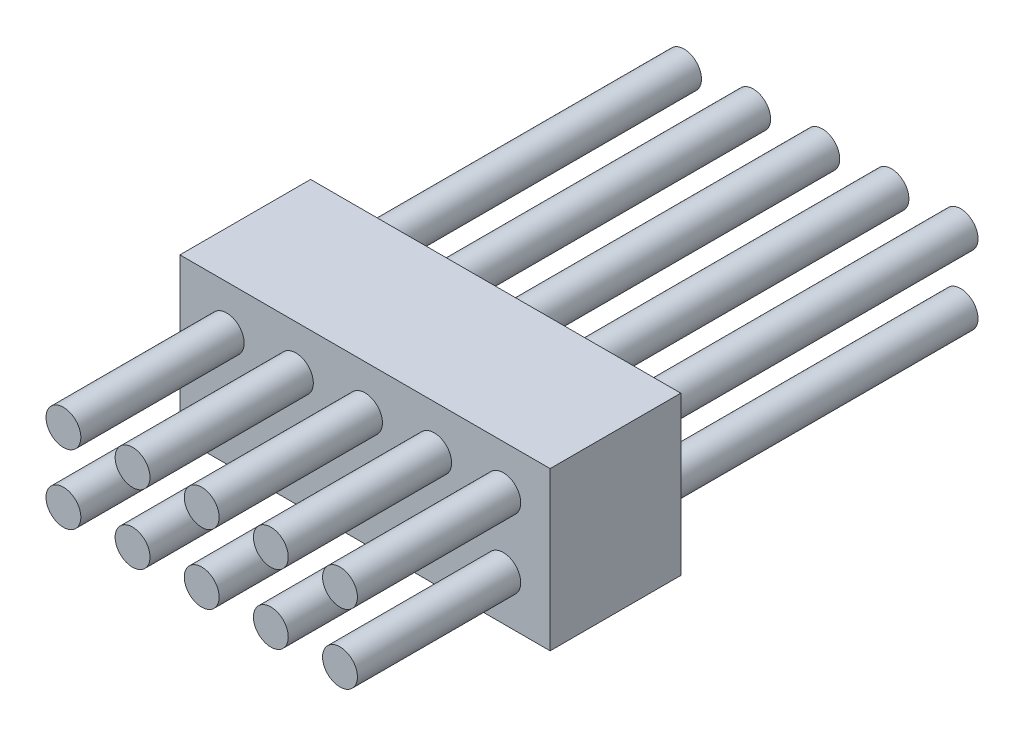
ISO-10303-21;
HEADER;
FILE_DESCRIPTION(('STEP AP214'),'2;1');
FILE_NAME('part.step','',(''),(''),'','','');
FILE_SCHEMA(('AUTOMOTIVE_DESIGN { 1 0 10303 214 1 1 1 1 }'));
ENDSEC;
DATA;
#1=APPLICATION_CONTEXT('core data for automotive mechanical design processes');
#2=APPLICATION_PROTOCOL_DEFINITION('international standard','automotive_design',2000,#1);
#3=PRODUCT_CONTEXT('',#1,'mechanical');
#4=PRODUCT('Part','Part','',(#3));
#5=PRODUCT_RELATED_PRODUCT_CATEGORY('part','',(#4));
#6=PRODUCT_DEFINITION_FORMATION('','',#4);
#7=PRODUCT_DEFINITION_CONTEXT('part definition',#1,'design');
#8=PRODUCT_DEFINITION('design','',#6,#7);
#9=PRODUCT_DEFINITION_SHAPE('','',#8);
#10=(LENGTH_UNIT() NAMED_UNIT(*) SI_UNIT(.MILLI.,.METRE.));
#11=(NAMED_UNIT(*) PLANE_ANGLE_UNIT() SI_UNIT($,.RADIAN.));
#12=(NAMED_UNIT(*) SI_UNIT($,.STERADIAN.) SOLID_ANGLE_UNIT());
#13=UNCERTAINTY_MEASURE_WITH_UNIT(LENGTH_MEASURE(1.E-05),#10,'distance_accuracy_value','');
#14=(GEOMETRIC_REPRESENTATION_CONTEXT(3) GLOBAL_UNCERTAINTY_ASSIGNED_CONTEXT((#13)) GLOBAL_UNIT_ASSIGNED_CONTEXT((#10,
#11,#12)) REPRESENTATION_CONTEXT('',''));
#15=CARTESIAN_POINT('',(0.,0.,0.));
#16=DIRECTION('',(0.,0.,1.));
#17=DIRECTION('',(1.,0.,0.));
#18=AXIS2_PLACEMENT_3D('',#15,#16,#17);
#19=CARTESIAN_POINT('',(0.,0.,2.4));
#20=DIRECTION('',(1.,0.,0.));
#21=DIRECTION('',(0.,0.,-1.));
#22=AXIS2_PLACEMENT_3D('',#19,#20,#21);
#23=PLANE('',#22);
#24=DIRECTION('',(0.,-1.,0.));
#25=VECTOR('',#24,1.);
#26=CARTESIAN_POINT('',(0.,0.,0.));
#27=LINE('',#26,#25);
#28=CARTESIAN_POINT('',(0.,2.9,0.));
#29=VERTEX_POINT('',#28);
#30=CARTESIAN_POINT('',(0.,0.,0.));
#31=VERTEX_POINT('',#30);
#32=EDGE_CURVE('E102',#29,#31,#27,.T.);
#33=ORIENTED_EDGE('',*,*,#32,.T.);
#34=DIRECTION('',(0.,0.,-1.));
#35=VECTOR('',#34,1.);
#36=CARTESIAN_POINT('',(0.,0.,2.4));
#37=LINE('',#36,#35);
#38=CARTESIAN_POINT('',(0.,0.,2.4));
#39=VERTEX_POINT('',#38);
#40=EDGE_CURVE('E93',#39,#31,#37,.T.);
#41=ORIENTED_EDGE('',*,*,#40,.F.);
#42=DIRECTION('',(0.,-1.,0.));
#43=VECTOR('',#42,1.);
#44=CARTESIAN_POINT('',(0.,0.,2.4));
#45=LINE('',#44,#43);
#46=CARTESIAN_POINT('',(0.,2.9,2.4));
#47=VERTEX_POINT('',#46);
#48=EDGE_CURVE('E87',#47,#39,#45,.T.);
#49=ORIENTED_EDGE('',*,*,#48,.F.);
#50=DIRECTION('',(0.,0.,-1.));
#51=VECTOR('',#50,1.);
#52=CARTESIAN_POINT('',(0.,2.9,2.4));
#53=LINE('',#52,#51);
#54=EDGE_CURVE('E98',#47,#29,#53,.T.);
#55=ORIENTED_EDGE('',*,*,#54,.T.);
#56=EDGE_LOOP('',(#33,#41,#49,#55));
#57=FACE_BOUND('',#56,.T.);
#58=ADVANCED_FACE('F35',(#57),#23,.F.);
#59=CARTESIAN_POINT('',(0.,0.,2.4));
#60=DIRECTION('',(0.,1.,0.));
#61=DIRECTION('',(0.,0.,1.));
#62=AXIS2_PLACEMENT_3D('',#59,#60,#61);
#63=PLANE('',#62);
#64=DIRECTION('',(1.,0.,0.));
#65=VECTOR('',#64,1.);
#66=CARTESIAN_POINT('',(0.,0.,0.));
#67=LINE('',#66,#65);
#68=CARTESIAN_POINT('',(6.8,0.,0.));
#69=VERTEX_POINT('',#68);
#70=EDGE_CURVE('E92',#31,#69,#67,.T.);
#71=ORIENTED_EDGE('',*,*,#70,.T.);
#72=DIRECTION('',(0.,0.,-1.));
#73=VECTOR('',#72,1.);
#74=CARTESIAN_POINT('',(6.8,0.,2.4));
#75=LINE('',#74,#73);
#76=CARTESIAN_POINT('',(6.8,0.,2.4));
#77=VERTEX_POINT('',#76);
#78=EDGE_CURVE('E90',#77,#69,#75,.T.);
#79=ORIENTED_EDGE('',*,*,#78,.F.);
#80=DIRECTION('',(1.,0.,0.));
#81=VECTOR('',#80,1.);
#82=CARTESIAN_POINT('',(0.,0.,2.4));
#83=LINE('',#82,#81);
#84=EDGE_CURVE('E82',#39,#77,#83,.T.);
#85=ORIENTED_EDGE('',*,*,#84,.F.);
#86=ORIENTED_EDGE('',*,*,#40,.T.);
#87=EDGE_LOOP('',(#71,#79,#85,#86));
#88=FACE_BOUND('',#87,.T.);
#89=ADVANCED_FACE('F91',(#88),#63,.F.);
#90=CARTESIAN_POINT('',(6.8,0.,2.4));
#91=DIRECTION('',(-1.,0.,0.));
#92=DIRECTION('',(0.,0.,1.));
#93=AXIS2_PLACEMENT_3D('',#90,#91,#92);
#94=PLANE('',#93);
#95=DIRECTION('',(0.,1.,0.));
#96=VECTOR('',#95,1.);
#97=CARTESIAN_POINT('',(6.8,0.,0.));
#98=LINE('',#97,#96);
#99=CARTESIAN_POINT('',(6.8,2.9,0.));
#100=VERTEX_POINT('',#99);
#101=EDGE_CURVE('E68',#69,#100,#98,.T.);
#102=ORIENTED_EDGE('',*,*,#101,.T.);
#103=DIRECTION('',(0.,0.,-1.));
#104=VECTOR('',#103,1.);
#105=CARTESIAN_POINT('',(6.8,2.9,2.4));
#106=LINE('',#105,#104);
#107=CARTESIAN_POINT('',(6.8,2.9,2.4));
#108=VERTEX_POINT('',#107);
#109=EDGE_CURVE('E94',#108,#100,#106,.T.);
#110=ORIENTED_EDGE('',*,*,#109,.F.);
#111=DIRECTION('',(0.,1.,0.));
#112=VECTOR('',#111,1.);
#113=CARTESIAN_POINT('',(6.8,0.,2.4));
#114=LINE('',#113,#112);
#115=EDGE_CURVE('E85',#77,#108,#114,.T.);
#116=ORIENTED_EDGE('',*,*,#115,.F.);
#117=ORIENTED_EDGE('',*,*,#78,.T.);
#118=EDGE_LOOP('',(#102,#110,#116,#117));
#119=FACE_BOUND('',#118,.T.);
#120=ADVANCED_FACE('F96',(#119),#94,.F.);
#121=CARTESIAN_POINT('',(0.,2.9,2.4));
#122=DIRECTION('',(0.,-1.,0.));
#123=DIRECTION('',(0.,0.,-1.));
#124=AXIS2_PLACEMENT_3D('',#121,#122,#123);
#125=PLANE('',#124);
#126=DIRECTION('',(-1.,0.,0.));
#127=VECTOR('',#126,1.);
#128=CARTESIAN_POINT('',(0.,2.9,0.));
#129=LINE('',#128,#127);
#130=EDGE_CURVE('E74',#100,#29,#129,.T.);
#131=ORIENTED_EDGE('',*,*,#130,.T.);
#132=ORIENTED_EDGE('',*,*,#54,.F.);
#133=DIRECTION('',(-1.,0.,0.));
#134=VECTOR('',#133,1.);
#135=CARTESIAN_POINT('',(0.,2.9,2.4));
#136=LINE('',#135,#134);
#137=EDGE_CURVE('E51',#108,#47,#136,.T.);
#138=ORIENTED_EDGE('',*,*,#137,.F.);
#139=ORIENTED_EDGE('',*,*,#109,.T.);
#140=EDGE_LOOP('',(#131,#132,#138,#139));
#141=FACE_BOUND('',#140,.T.);
#142=ADVANCED_FACE('F143',(#141),#125,.F.);
#143=CARTESIAN_POINT('',(0.,0.,2.4));
#144=DIRECTION('',(0.,0.,-1.));
#145=DIRECTION('',(-1.,0.,0.));
#146=AXIS2_PLACEMENT_3D('',#143,#144,#145);
#147=PLANE('',#146);
#148=CARTESIAN_POINT('',(5.94,2.085,2.4));
#149=DIRECTION('',(0.,0.,-1.));
#150=DIRECTION('',(-1.,0.,0.));
#151=AXIS2_PLACEMENT_3D('',#148,#149,#150);
#152=CIRCLE('',#151,0.32);
#153=CARTESIAN_POINT('',(5.62,2.085,2.4));
#154=VERTEX_POINT('',#153);
#155=EDGE_CURVE('E11',#154,#154,#152,.F.);
#156=ORIENTED_EDGE('',*,*,#155,.F.);
#157=EDGE_LOOP('',(#156));
#158=FACE_BOUND('',#157,.T.);
#159=CARTESIAN_POINT('',(5.94,0.815,2.4));
#160=DIRECTION('',(0.,0.,-1.));
#161=DIRECTION('',(-1.,0.,0.));
#162=AXIS2_PLACEMENT_3D('',#159,#160,#161);
#163=CIRCLE('',#162,0.32);
#164=CARTESIAN_POINT('',(5.62,0.815,2.4));
#165=VERTEX_POINT('',#164);
#166=EDGE_CURVE('E43',#165,#165,#163,.F.);
#167=ORIENTED_EDGE('',*,*,#166,.F.);
#168=EDGE_LOOP('',(#167));
#169=FACE_BOUND('',#168,.T.);
#170=CARTESIAN_POINT('',(4.67,2.085,2.4));
#171=DIRECTION('',(0.,0.,-1.));
#172=DIRECTION('',(-1.,0.,0.));
#173=AXIS2_PLACEMENT_3D('',#170,#171,#172);
#174=CIRCLE('',#173,0.32);
#175=CARTESIAN_POINT('',(4.35,2.085,2.4));
#176=VERTEX_POINT('',#175);
#177=EDGE_CURVE('E133',#176,#176,#174,.F.);
#178=ORIENTED_EDGE('',*,*,#177,.F.);
#179=EDGE_LOOP('',(#178));
#180=FACE_BOUND('',#179,.T.);
#181=CARTESIAN_POINT('',(4.67,0.815,2.4));
#182=DIRECTION('',(0.,0.,-1.));
#183=DIRECTION('',(-1.,0.,0.));
#184=AXIS2_PLACEMENT_3D('',#181,#182,#183);
#185=CIRCLE('',#184,0.32);
#186=CARTESIAN_POINT('',(4.35,0.815,2.4));
#187=VERTEX_POINT('',#186);
#188=EDGE_CURVE('E130',#187,#187,#185,.F.);
#189=ORIENTED_EDGE('',*,*,#188,.F.);
#190=EDGE_LOOP('',(#189));
#191=FACE_BOUND('',#190,.T.);
#192=CARTESIAN_POINT('',(3.4,2.085,2.4));
#193=DIRECTION('',(0.,0.,-1.));
#194=DIRECTION('',(-1.,0.,0.));
#195=AXIS2_PLACEMENT_3D('',#192,#193,#194);
#196=CIRCLE('',#195,0.32);
#197=CARTESIAN_POINT('',(3.08,2.085,2.4));
#198=VERTEX_POINT('',#197);
#199=EDGE_CURVE('E127',#198,#198,#196,.F.);
#200=ORIENTED_EDGE('',*,*,#199,.F.);
#201=EDGE_LOOP('',(#200));
#202=FACE_BOUND('',#201,.T.);
#203=CARTESIAN_POINT('',(3.4,0.815,2.4));
#204=DIRECTION('',(0.,0.,-1.));
#205=DIRECTION('',(-1.,0.,0.));
#206=AXIS2_PLACEMENT_3D('',#203,#204,#205);
#207=CIRCLE('',#206,0.32);
#208=CARTESIAN_POINT('',(3.08,0.815,2.4));
#209=VERTEX_POINT('',#208);
#210=EDGE_CURVE('E124',#209,#209,#207,.F.);
#211=ORIENTED_EDGE('',*,*,#210,.F.);
#212=EDGE_LOOP('',(#211));
#213=FACE_BOUND('',#212,.T.);
#214=CARTESIAN_POINT('',(2.13,2.085,2.4));
#215=DIRECTION('',(0.,0.,-1.));
#216=DIRECTION('',(-1.,0.,0.));
#217=AXIS2_PLACEMENT_3D('',#214,#215,#216);
#218=CIRCLE('',#217,0.32);
#219=CARTESIAN_POINT('',(1.81,2.085,2.4));
#220=VERTEX_POINT('',#219);
#221=EDGE_CURVE('E121',#220,#220,#218,.F.);
#222=ORIENTED_EDGE('',*,*,#221,.F.);
#223=EDGE_LOOP('',(#222));
#224=FACE_BOUND('',#223,.T.);
#225=CARTESIAN_POINT('',(2.13,0.815,2.4));
#226=DIRECTION('',(0.,0.,-1.));
#227=DIRECTION('',(-1.,0.,0.));
#228=AXIS2_PLACEMENT_3D('',#225,#226,#227);
#229=CIRCLE('',#228,0.32);
#230=CARTESIAN_POINT('',(1.81,0.815,2.4));
#231=VERTEX_POINT('',#230);
#232=EDGE_CURVE('E118',#231,#231,#229,.F.);
#233=ORIENTED_EDGE('',*,*,#232,.F.);
#234=EDGE_LOOP('',(#233));
#235=FACE_BOUND('',#234,.T.);
#236=CARTESIAN_POINT('',(0.86,2.085,2.4));
#237=DIRECTION('',(0.,0.,-1.));
#238=DIRECTION('',(-1.,0.,0.));
#239=AXIS2_PLACEMENT_3D('',#236,#237,#238);
#240=CIRCLE('',#239,0.32);
#241=CARTESIAN_POINT('',(0.54,2.085,2.4));
#242=VERTEX_POINT('',#241);
#243=EDGE_CURVE('E115',#242,#242,#240,.F.);
#244=ORIENTED_EDGE('',*,*,#243,.F.);
#245=EDGE_LOOP('',(#244));
#246=FACE_BOUND('',#245,.T.);
#247=CARTESIAN_POINT('',(0.86,0.815,2.4));
#248=DIRECTION('',(0.,0.,-1.));
#249=DIRECTION('',(-1.,0.,0.));
#250=AXIS2_PLACEMENT_3D('',#247,#248,#249);
#251=CIRCLE('',#250,0.32);
#252=CARTESIAN_POINT('',(0.54,0.815,2.4));
#253=VERTEX_POINT('',#252);
#254=EDGE_CURVE('E112',#253,#253,#251,.F.);
#255=ORIENTED_EDGE('',*,*,#254,.F.);
#256=EDGE_LOOP('',(#255));
#257=FACE_BOUND('',#256,.T.);
#258=ORIENTED_EDGE('',*,*,#48,.T.);
#259=ORIENTED_EDGE('',*,*,#84,.T.);
#260=ORIENTED_EDGE('',*,*,#115,.T.);
#261=ORIENTED_EDGE('',*,*,#137,.T.);
#262=EDGE_LOOP('',(#258,#259,#260,#261));
#263=FACE_BOUND('',#262,.T.);
#264=ADVANCED_FACE('F83',(#158,#169,#180,#191,#202,#213,#224,#235,#246,#257,#263),#147,.F.);
#265=CARTESIAN_POINT('',(0.,0.,0.));
#266=DIRECTION('',(0.,0.,-1.));
#267=DIRECTION('',(-1.,0.,0.));
#268=AXIS2_PLACEMENT_3D('',#265,#266,#267);
#269=PLANE('',#268);
#270=CARTESIAN_POINT('',(5.94,2.085,0.));
#271=DIRECTION('',(0.,0.,-1.));
#272=DIRECTION('',(-1.,0.,0.));
#273=AXIS2_PLACEMENT_3D('',#270,#271,#272);
#274=CIRCLE('',#273,0.32);
#275=CARTESIAN_POINT('',(5.62,2.085,0.));
#276=VERTEX_POINT('',#275);
#277=EDGE_CURVE('E612',#276,#276,#274,.T.);
#278=ORIENTED_EDGE('',*,*,#277,.F.);
#279=EDGE_LOOP('',(#278));
#280=FACE_BOUND('',#279,.T.);
#281=CARTESIAN_POINT('',(5.94,0.815,0.));
#282=DIRECTION('',(0.,0.,-1.));
#283=DIRECTION('',(-1.,0.,0.));
#284=AXIS2_PLACEMENT_3D('',#281,#282,#283);
#285=CIRCLE('',#284,0.32);
#286=CARTESIAN_POINT('',(5.62,0.815,0.));
#287=VERTEX_POINT('',#286);
#288=EDGE_CURVE('E611',#287,#287,#285,.T.);
#289=ORIENTED_EDGE('',*,*,#288,.F.);
#290=EDGE_LOOP('',(#289));
#291=FACE_BOUND('',#290,.T.);
#292=CARTESIAN_POINT('',(4.67,2.085,0.));
#293=DIRECTION('',(0.,0.,-1.));
#294=DIRECTION('',(-1.,0.,0.));
#295=AXIS2_PLACEMENT_3D('',#292,#293,#294);
#296=CIRCLE('',#295,0.32);
#297=CARTESIAN_POINT('',(4.35,2.085,0.));
#298=VERTEX_POINT('',#297);
#299=EDGE_CURVE('E621',#298,#298,#296,.T.);
#300=ORIENTED_EDGE('',*,*,#299,.F.);
#301=EDGE_LOOP('',(#300));
#302=FACE_BOUND('',#301,.T.);
#303=CARTESIAN_POINT('',(4.67,0.815,0.));
#304=DIRECTION('',(0.,0.,-1.));
#305=DIRECTION('',(-1.,0.,0.));
#306=AXIS2_PLACEMENT_3D('',#303,#304,#305);
#307=CIRCLE('',#306,0.32);
#308=CARTESIAN_POINT('',(4.35,0.815,0.));
#309=VERTEX_POINT('',#308);
#310=EDGE_CURVE('E626',#309,#309,#307,.T.);
#311=ORIENTED_EDGE('',*,*,#310,.F.);
#312=EDGE_LOOP('',(#311));
#313=FACE_BOUND('',#312,.T.);
#314=CARTESIAN_POINT('',(3.4,2.085,0.));
#315=DIRECTION('',(0.,0.,-1.));
#316=DIRECTION('',(-1.,0.,0.));
#317=AXIS2_PLACEMENT_3D('',#314,#315,#316);
#318=CIRCLE('',#317,0.32);
#319=CARTESIAN_POINT('',(3.08,2.085,0.));
#320=VERTEX_POINT('',#319);
#321=EDGE_CURVE('E632',#320,#320,#318,.T.);
#322=ORIENTED_EDGE('',*,*,#321,.F.);
#323=EDGE_LOOP('',(#322));
#324=FACE_BOUND('',#323,.T.);
#325=CARTESIAN_POINT('',(3.4,0.815,0.));
#326=DIRECTION('',(0.,0.,-1.));
#327=DIRECTION('',(-1.,0.,0.));
#328=AXIS2_PLACEMENT_3D('',#325,#326,#327);
#329=CIRCLE('',#328,0.32);
#330=CARTESIAN_POINT('',(3.08,0.815,0.));
#331=VERTEX_POINT('',#330);
#332=EDGE_CURVE('E638',#331,#331,#329,.T.);
#333=ORIENTED_EDGE('',*,*,#332,.F.);
#334=EDGE_LOOP('',(#333));
#335=FACE_BOUND('',#334,.T.);
#336=CARTESIAN_POINT('',(2.13,2.085,0.));
#337=DIRECTION('',(0.,0.,-1.));
#338=DIRECTION('',(-1.,0.,0.));
#339=AXIS2_PLACEMENT_3D('',#336,#337,#338);
#340=CIRCLE('',#339,0.32);
#341=CARTESIAN_POINT('',(1.81,2.085,0.));
#342=VERTEX_POINT('',#341);
#343=EDGE_CURVE('E644',#342,#342,#340,.T.);
#344=ORIENTED_EDGE('',*,*,#343,.F.);
#345=EDGE_LOOP('',(#344));
#346=FACE_BOUND('',#345,.T.);
#347=CARTESIAN_POINT('',(2.13,0.815,0.));
#348=DIRECTION('',(0.,0.,-1.));
#349=DIRECTION('',(-1.,0.,0.));
#350=AXIS2_PLACEMENT_3D('',#347,#348,#349);
#351=CIRCLE('',#350,0.32);
#352=CARTESIAN_POINT('',(1.81,0.815,0.));
#353=VERTEX_POINT('',#352);
#354=EDGE_CURVE('E650',#353,#353,#351,.T.);
#355=ORIENTED_EDGE('',*,*,#354,.F.);
#356=EDGE_LOOP('',(#355));
#357=FACE_BOUND('',#356,.T.);
#358=CARTESIAN_POINT('',(0.86,2.085,0.));
#359=DIRECTION('',(0.,0.,-1.));
#360=DIRECTION('',(-1.,0.,0.));
#361=AXIS2_PLACEMENT_3D('',#358,#359,#360);
#362=CIRCLE('',#361,0.32);
#363=CARTESIAN_POINT('',(0.54,2.085,0.));
#364=VERTEX_POINT('',#363);
#365=EDGE_CURVE('E656',#364,#364,#362,.T.);
#366=ORIENTED_EDGE('',*,*,#365,.F.);
#367=EDGE_LOOP('',(#366));
#368=FACE_BOUND('',#367,.T.);
#369=CARTESIAN_POINT('',(0.86,0.815,0.));
#370=DIRECTION('',(0.,0.,-1.));
#371=DIRECTION('',(-1.,0.,0.));
#372=AXIS2_PLACEMENT_3D('',#369,#370,#371);
#373=CIRCLE('',#372,0.32);
#374=CARTESIAN_POINT('',(0.54,0.815,0.));
#375=VERTEX_POINT('',#374);
#376=EDGE_CURVE('E662',#375,#375,#373,.T.);
#377=ORIENTED_EDGE('',*,*,#376,.F.);
#378=EDGE_LOOP('',(#377));
#379=FACE_BOUND('',#378,.T.);
#380=ORIENTED_EDGE('',*,*,#32,.F.);
#381=ORIENTED_EDGE('',*,*,#130,.F.);
#382=ORIENTED_EDGE('',*,*,#101,.F.);
#383=ORIENTED_EDGE('',*,*,#70,.F.);
#384=EDGE_LOOP('',(#380,#381,#382,#383));
#385=FACE_BOUND('',#384,.T.);
#386=ADVANCED_FACE('F142',(#280,#291,#302,#313,#324,#335,#346,#357,#368,#379,#385),#269,.T.);
#387=CARTESIAN_POINT('',(0.86,0.815,5.4));
#388=DIRECTION('',(0.,0.,-1.));
#389=DIRECTION('',(-1.,0.,0.));
#390=AXIS2_PLACEMENT_3D('',#387,#388,#389);
#391=CYLINDRICAL_SURFACE('',#390,0.32);
#392=CARTESIAN_POINT('',(0.86,0.815,5.4));
#393=DIRECTION('',(0.,0.,1.));
#394=DIRECTION('',(1.,0.,0.));
#395=AXIS2_PLACEMENT_3D('',#392,#393,#394);
#396=CIRCLE('',#395,0.32);
#397=CARTESIAN_POINT('',(1.18,0.815,5.4));
#398=VERTEX_POINT('',#397);
#399=EDGE_CURVE('E105',#398,#398,#396,.T.);
#400=ORIENTED_EDGE('',*,*,#399,.F.);
#401=EDGE_LOOP('',(#400));
#402=FACE_BOUND('',#401,.T.);
#403=ORIENTED_EDGE('',*,*,#254,.T.);
#404=EDGE_LOOP('',(#403));
#405=FACE_BOUND('',#404,.T.);
#406=ADVANCED_FACE('F162',(#402,#405),#391,.T.);
#407=CARTESIAN_POINT('',(0.86,0.815,5.4));
#408=DIRECTION('',(0.,0.,1.));
#409=DIRECTION('',(1.,0.,0.));
#410=AXIS2_PLACEMENT_3D('',#407,#408,#409);
#411=PLANE('',#410);
#412=ORIENTED_EDGE('',*,*,#399,.T.);
#413=EDGE_LOOP('',(#412));
#414=FACE_BOUND('',#413,.T.);
#415=ADVANCED_FACE('F164',(#414),#411,.T.);
#416=CARTESIAN_POINT('',(0.86,2.085,5.4));
#417=DIRECTION('',(0.,0.,-1.));
#418=DIRECTION('',(-1.,0.,0.));
#419=AXIS2_PLACEMENT_3D('',#416,#417,#418);
#420=CYLINDRICAL_SURFACE('',#419,0.32);
#421=CARTESIAN_POINT('',(0.86,2.085,5.4));
#422=DIRECTION('',(0.,0.,1.));
#423=DIRECTION('',(-1.,0.,0.));
#424=AXIS2_PLACEMENT_3D('',#421,#422,#423);
#425=CIRCLE('',#424,0.32);
#426=CARTESIAN_POINT('',(0.54,2.085,5.4));
#427=VERTEX_POINT('',#426);
#428=EDGE_CURVE('E694',#427,#427,#425,.T.);
#429=ORIENTED_EDGE('',*,*,#428,.F.);
#430=EDGE_LOOP('',(#429));
#431=FACE_BOUND('',#430,.T.);
#432=ORIENTED_EDGE('',*,*,#243,.T.);
#433=EDGE_LOOP('',(#432));
#434=FACE_BOUND('',#433,.T.);
#435=ADVANCED_FACE('F171',(#431,#434),#420,.T.);
#436=CARTESIAN_POINT('',(0.86,2.085,5.4));
#437=DIRECTION('',(0.,0.,-1.));
#438=DIRECTION('',(-1.,0.,0.));
#439=AXIS2_PLACEMENT_3D('',#436,#437,#438);
#440=PLANE('',#439);
#441=ORIENTED_EDGE('',*,*,#428,.T.);
#442=EDGE_LOOP('',(#441));
#443=FACE_BOUND('',#442,.T.);
#444=ADVANCED_FACE('F237',(#443),#440,.F.);
#445=CARTESIAN_POINT('',(2.13,0.815,5.4));
#446=DIRECTION('',(0.,0.,-1.));
#447=DIRECTION('',(-1.,0.,0.));
#448=AXIS2_PLACEMENT_3D('',#445,#446,#447);
#449=CYLINDRICAL_SURFACE('',#448,0.32);
#450=CARTESIAN_POINT('',(2.13,0.815,5.4));
#451=DIRECTION('',(0.,0.,1.));
#452=DIRECTION('',(1.,0.,0.));
#453=AXIS2_PLACEMENT_3D('',#450,#451,#452);
#454=CIRCLE('',#453,0.32);
#455=CARTESIAN_POINT('',(2.45,0.815,5.4));
#456=VERTEX_POINT('',#455);
#457=EDGE_CURVE('E691',#456,#456,#454,.T.);
#458=ORIENTED_EDGE('',*,*,#457,.F.);
#459=EDGE_LOOP('',(#458));
#460=FACE_BOUND('',#459,.T.);
#461=ORIENTED_EDGE('',*,*,#232,.T.);
#462=EDGE_LOOP('',(#461));
#463=FACE_BOUND('',#462,.T.);
#464=ADVANCED_FACE('F246',(#460,#463),#449,.T.);
#465=CARTESIAN_POINT('',(2.13,0.815,5.4));
#466=DIRECTION('',(0.,0.,1.));
#467=DIRECTION('',(1.,0.,0.));
#468=AXIS2_PLACEMENT_3D('',#465,#466,#467);
#469=PLANE('',#468);
#470=ORIENTED_EDGE('',*,*,#457,.T.);
#471=EDGE_LOOP('',(#470));
#472=FACE_BOUND('',#471,.T.);
#473=ADVANCED_FACE('F255',(#472),#469,.T.);
#474=CARTESIAN_POINT('',(2.13,2.085,5.4));
#475=DIRECTION('',(0.,0.,-1.));
#476=DIRECTION('',(-1.,0.,0.));
#477=AXIS2_PLACEMENT_3D('',#474,#475,#476);
#478=CYLINDRICAL_SURFACE('',#477,0.32);
#479=CARTESIAN_POINT('',(2.13,2.085,5.4));
#480=DIRECTION('',(0.,0.,1.));
#481=DIRECTION('',(-1.,0.,0.));
#482=AXIS2_PLACEMENT_3D('',#479,#480,#481);
#483=CIRCLE('',#482,0.32);
#484=CARTESIAN_POINT('',(1.81,2.085,5.4));
#485=VERTEX_POINT('',#484);
#486=EDGE_CURVE('E688',#485,#485,#483,.T.);
#487=ORIENTED_EDGE('',*,*,#486,.F.);
#488=EDGE_LOOP('',(#487));
#489=FACE_BOUND('',#488,.T.);
#490=ORIENTED_EDGE('',*,*,#221,.T.);
#491=EDGE_LOOP('',(#490));
#492=FACE_BOUND('',#491,.T.);
#493=ADVANCED_FACE('F264',(#489,#492),#478,.T.);
#494=CARTESIAN_POINT('',(2.13,2.085,5.4));
#495=DIRECTION('',(0.,0.,-1.));
#496=DIRECTION('',(-1.,0.,0.));
#497=AXIS2_PLACEMENT_3D('',#494,#495,#496);
#498=PLANE('',#497);
#499=ORIENTED_EDGE('',*,*,#486,.T.);
#500=EDGE_LOOP('',(#499));
#501=FACE_BOUND('',#500,.T.);
#502=ADVANCED_FACE('F273',(#501),#498,.F.);
#503=CARTESIAN_POINT('',(3.4,0.815,5.4));
#504=DIRECTION('',(0.,0.,-1.));
#505=DIRECTION('',(-1.,0.,0.));
#506=AXIS2_PLACEMENT_3D('',#503,#504,#505);
#507=CYLINDRICAL_SURFACE('',#506,0.32);
#508=CARTESIAN_POINT('',(3.4,0.815,5.4));
#509=DIRECTION('',(0.,0.,1.));
#510=DIRECTION('',(1.,0.,0.));
#511=AXIS2_PLACEMENT_3D('',#508,#509,#510);
#512=CIRCLE('',#511,0.32);
#513=CARTESIAN_POINT('',(3.72,0.815,5.4));
#514=VERTEX_POINT('',#513);
#515=EDGE_CURVE('E685',#514,#514,#512,.T.);
#516=ORIENTED_EDGE('',*,*,#515,.F.);
#517=EDGE_LOOP('',(#516));
#518=FACE_BOUND('',#517,.T.);
#519=ORIENTED_EDGE('',*,*,#210,.T.);
#520=EDGE_LOOP('',(#519));
#521=FACE_BOUND('',#520,.T.);
#522=ADVANCED_FACE('F282',(#518,#521),#507,.T.);
#523=CARTESIAN_POINT('',(3.4,0.815,5.4));
#524=DIRECTION('',(0.,0.,1.));
#525=DIRECTION('',(1.,0.,0.));
#526=AXIS2_PLACEMENT_3D('',#523,#524,#525);
#527=PLANE('',#526);
#528=ORIENTED_EDGE('',*,*,#515,.T.);
#529=EDGE_LOOP('',(#528));
#530=FACE_BOUND('',#529,.T.);
#531=ADVANCED_FACE('F291',(#530),#527,.T.);
#532=CARTESIAN_POINT('',(3.4,2.085,5.4));
#533=DIRECTION('',(0.,0.,-1.));
#534=DIRECTION('',(-1.,0.,0.));
#535=AXIS2_PLACEMENT_3D('',#532,#533,#534);
#536=CYLINDRICAL_SURFACE('',#535,0.32);
#537=CARTESIAN_POINT('',(3.4,2.085,5.4));
#538=DIRECTION('',(0.,0.,1.));
#539=DIRECTION('',(-1.,0.,0.));
#540=AXIS2_PLACEMENT_3D('',#537,#538,#539);
#541=CIRCLE('',#540,0.32);
#542=CARTESIAN_POINT('',(3.08,2.085,5.4));
#543=VERTEX_POINT('',#542);
#544=EDGE_CURVE('E682',#543,#543,#541,.T.);
#545=ORIENTED_EDGE('',*,*,#544,.F.);
#546=EDGE_LOOP('',(#545));
#547=FACE_BOUND('',#546,.T.);
#548=ORIENTED_EDGE('',*,*,#199,.T.);
#549=EDGE_LOOP('',(#548));
#550=FACE_BOUND('',#549,.T.);
#551=ADVANCED_FACE('F300',(#547,#550),#536,.T.);
#552=CARTESIAN_POINT('',(3.4,2.085,5.4));
#553=DIRECTION('',(0.,0.,-1.));
#554=DIRECTION('',(-1.,0.,0.));
#555=AXIS2_PLACEMENT_3D('',#552,#553,#554);
#556=PLANE('',#555);
#557=ORIENTED_EDGE('',*,*,#544,.T.);
#558=EDGE_LOOP('',(#557));
#559=FACE_BOUND('',#558,.T.);
#560=ADVANCED_FACE('F309',(#559),#556,.F.);
#561=CARTESIAN_POINT('',(4.67,0.815,5.4));
#562=DIRECTION('',(0.,0.,-1.));
#563=DIRECTION('',(-1.,0.,0.));
#564=AXIS2_PLACEMENT_3D('',#561,#562,#563);
#565=CYLINDRICAL_SURFACE('',#564,0.32);
#566=CARTESIAN_POINT('',(4.67,0.815,5.4));
#567=DIRECTION('',(0.,0.,1.));
#568=DIRECTION('',(1.,0.,0.));
#569=AXIS2_PLACEMENT_3D('',#566,#567,#568);
#570=CIRCLE('',#569,0.32);
#571=CARTESIAN_POINT('',(4.99,0.815,5.4));
#572=VERTEX_POINT('',#571);
#573=EDGE_CURVE('E679',#572,#572,#570,.T.);
#574=ORIENTED_EDGE('',*,*,#573,.F.);
#575=EDGE_LOOP('',(#574));
#576=FACE_BOUND('',#575,.T.);
#577=ORIENTED_EDGE('',*,*,#188,.T.);
#578=EDGE_LOOP('',(#577));
#579=FACE_BOUND('',#578,.T.);
#580=ADVANCED_FACE('F318',(#576,#579),#565,.T.);
#581=CARTESIAN_POINT('',(4.67,0.815,5.4));
#582=DIRECTION('',(0.,0.,1.));
#583=DIRECTION('',(1.,0.,0.));
#584=AXIS2_PLACEMENT_3D('',#581,#582,#583);
#585=PLANE('',#584);
#586=ORIENTED_EDGE('',*,*,#573,.T.);
#587=EDGE_LOOP('',(#586));
#588=FACE_BOUND('',#587,.T.);
#589=ADVANCED_FACE('F327',(#588),#585,.T.);
#590=CARTESIAN_POINT('',(4.67,2.085,5.4));
#591=DIRECTION('',(0.,0.,-1.));
#592=DIRECTION('',(-1.,0.,0.));
#593=AXIS2_PLACEMENT_3D('',#590,#591,#592);
#594=CYLINDRICAL_SURFACE('',#593,0.32);
#595=CARTESIAN_POINT('',(4.67,2.085,5.4));
#596=DIRECTION('',(0.,0.,1.));
#597=DIRECTION('',(-1.,0.,0.));
#598=AXIS2_PLACEMENT_3D('',#595,#596,#597);
#599=CIRCLE('',#598,0.32);
#600=CARTESIAN_POINT('',(4.35,2.085,5.4));
#601=VERTEX_POINT('',#600);
#602=EDGE_CURVE('E676',#601,#601,#599,.T.);
#603=ORIENTED_EDGE('',*,*,#602,.F.);
#604=EDGE_LOOP('',(#603));
#605=FACE_BOUND('',#604,.T.);
#606=ORIENTED_EDGE('',*,*,#177,.T.);
#607=EDGE_LOOP('',(#606));
#608=FACE_BOUND('',#607,.T.);
#609=ADVANCED_FACE('F336',(#605,#608),#594,.T.);
#610=CARTESIAN_POINT('',(4.67,2.085,5.4));
#611=DIRECTION('',(0.,0.,-1.));
#612=DIRECTION('',(-1.,0.,0.));
#613=AXIS2_PLACEMENT_3D('',#610,#611,#612);
#614=PLANE('',#613);
#615=ORIENTED_EDGE('',*,*,#602,.T.);
#616=EDGE_LOOP('',(#615));
#617=FACE_BOUND('',#616,.T.);
#618=ADVANCED_FACE('F345',(#617),#614,.F.);
#619=CARTESIAN_POINT('',(5.94,0.815,5.4));
#620=DIRECTION('',(0.,0.,-1.));
#621=DIRECTION('',(-1.,0.,0.));
#622=AXIS2_PLACEMENT_3D('',#619,#620,#621);
#623=CYLINDRICAL_SURFACE('',#622,0.32);
#624=CARTESIAN_POINT('',(5.94,0.815,5.4));
#625=DIRECTION('',(0.,0.,1.));
#626=DIRECTION('',(1.,0.,0.));
#627=AXIS2_PLACEMENT_3D('',#624,#625,#626);
#628=CIRCLE('',#627,0.32);
#629=CARTESIAN_POINT('',(6.26,0.815,5.4));
#630=VERTEX_POINT('',#629);
#631=EDGE_CURVE('E673',#630,#630,#628,.T.);
#632=ORIENTED_EDGE('',*,*,#631,.F.);
#633=EDGE_LOOP('',(#632));
#634=FACE_BOUND('',#633,.T.);
#635=ORIENTED_EDGE('',*,*,#166,.T.);
#636=EDGE_LOOP('',(#635));
#637=FACE_BOUND('',#636,.T.);
#638=ADVANCED_FACE('F138',(#634,#637),#623,.T.);
#639=CARTESIAN_POINT('',(5.94,0.815,5.4));
#640=DIRECTION('',(0.,0.,1.));
#641=DIRECTION('',(1.,0.,0.));
#642=AXIS2_PLACEMENT_3D('',#639,#640,#641);
#643=PLANE('',#642);
#644=ORIENTED_EDGE('',*,*,#631,.T.);
#645=EDGE_LOOP('',(#644));
#646=FACE_BOUND('',#645,.T.);
#647=ADVANCED_FACE('F362',(#646),#643,.T.);
#648=CARTESIAN_POINT('',(5.94,2.085,5.4));
#649=DIRECTION('',(0.,0.,-1.));
#650=DIRECTION('',(-1.,0.,0.));
#651=AXIS2_PLACEMENT_3D('',#648,#649,#650);
#652=CYLINDRICAL_SURFACE('',#651,0.32);
#653=CARTESIAN_POINT('',(5.94,2.085,5.4));
#654=DIRECTION('',(0.,0.,1.));
#655=DIRECTION('',(-1.,0.,0.));
#656=AXIS2_PLACEMENT_3D('',#653,#654,#655);
#657=CIRCLE('',#656,0.32);
#658=CARTESIAN_POINT('',(5.62,2.085,5.4));
#659=VERTEX_POINT('',#658);
#660=EDGE_CURVE('E668',#659,#659,#657,.T.);
#661=ORIENTED_EDGE('',*,*,#660,.F.);
#662=EDGE_LOOP('',(#661));
#663=FACE_BOUND('',#662,.T.);
#664=ORIENTED_EDGE('',*,*,#155,.T.);
#665=EDGE_LOOP('',(#664));
#666=FACE_BOUND('',#665,.T.);
#667=ADVANCED_FACE('F371',(#663,#666),#652,.T.);
#668=CARTESIAN_POINT('',(5.94,2.085,5.4));
#669=DIRECTION('',(0.,0.,-1.));
#670=DIRECTION('',(-1.,0.,0.));
#671=AXIS2_PLACEMENT_3D('',#668,#669,#670);
#672=PLANE('',#671);
#673=ORIENTED_EDGE('',*,*,#660,.T.);
#674=EDGE_LOOP('',(#673));
#675=FACE_BOUND('',#674,.T.);
#676=ADVANCED_FACE('F380',(#675),#672,.F.);
#677=CARTESIAN_POINT('',(0.86,0.815,-6.));
#678=DIRECTION('',(0.,0.,1.));
#679=DIRECTION('',(1.,0.,0.));
#680=AXIS2_PLACEMENT_3D('',#677,#678,#679);
#681=CYLINDRICAL_SURFACE('',#680,0.32);
#682=CARTESIAN_POINT('',(0.86,0.815,-6.));
#683=DIRECTION('',(0.,0.,-1.));
#684=DIRECTION('',(-1.,0.,0.));
#685=AXIS2_PLACEMENT_3D('',#682,#683,#684);
#686=CIRCLE('',#685,0.32);
#687=CARTESIAN_POINT('',(0.54,0.815,-6.));
#688=VERTEX_POINT('',#687);
#689=EDGE_CURVE('E665',#688,#688,#686,.T.);
#690=ORIENTED_EDGE('',*,*,#689,.F.);
#691=EDGE_LOOP('',(#690));
#692=FACE_BOUND('',#691,.T.);
#693=ORIENTED_EDGE('',*,*,#376,.T.);
#694=EDGE_LOOP('',(#693));
#695=FACE_BOUND('',#694,.T.);
#696=ADVANCED_FACE('F388',(#692,#695),#681,.T.);
#697=CARTESIAN_POINT('',(0.86,0.815,-6.));
#698=DIRECTION('',(0.,0.,-1.));
#699=DIRECTION('',(-1.,0.,0.));
#700=AXIS2_PLACEMENT_3D('',#697,#698,#699);
#701=PLANE('',#700);
#702=ORIENTED_EDGE('',*,*,#689,.T.);
#703=EDGE_LOOP('',(#702));
#704=FACE_BOUND('',#703,.T.);
#705=ADVANCED_FACE('F396',(#704),#701,.T.);
#706=CARTESIAN_POINT('',(0.86,2.085,-6.));
#707=DIRECTION('',(0.,0.,1.));
#708=DIRECTION('',(1.,0.,0.));
#709=AXIS2_PLACEMENT_3D('',#706,#707,#708);
#710=CYLINDRICAL_SURFACE('',#709,0.32);
#711=CARTESIAN_POINT('',(0.86,2.085,-6.));
#712=DIRECTION('',(0.,0.,-1.));
#713=DIRECTION('',(-1.,0.,0.));
#714=AXIS2_PLACEMENT_3D('',#711,#712,#713);
#715=CIRCLE('',#714,0.32);
#716=CARTESIAN_POINT('',(0.54,2.085,-6.));
#717=VERTEX_POINT('',#716);
#718=EDGE_CURVE('E659',#717,#717,#715,.T.);
#719=ORIENTED_EDGE('',*,*,#718,.F.);
#720=EDGE_LOOP('',(#719));
#721=FACE_BOUND('',#720,.T.);
#722=ORIENTED_EDGE('',*,*,#365,.T.);
#723=EDGE_LOOP('',(#722));
#724=FACE_BOUND('',#723,.T.);
#725=ADVANCED_FACE('F405',(#721,#724),#710,.T.);
#726=CARTESIAN_POINT('',(0.86,2.085,-6.));
#727=DIRECTION('',(0.,0.,-1.));
#728=DIRECTION('',(-1.,0.,0.));
#729=AXIS2_PLACEMENT_3D('',#726,#727,#728);
#730=PLANE('',#729);
#731=ORIENTED_EDGE('',*,*,#718,.T.);
#732=EDGE_LOOP('',(#731));
#733=FACE_BOUND('',#732,.T.);
#734=ADVANCED_FACE('F414',(#733),#730,.T.);
#735=CARTESIAN_POINT('',(2.13,0.815,-6.));
#736=DIRECTION('',(0.,0.,1.));
#737=DIRECTION('',(1.,0.,0.));
#738=AXIS2_PLACEMENT_3D('',#735,#736,#737);
#739=CYLINDRICAL_SURFACE('',#738,0.32);
#740=CARTESIAN_POINT('',(2.13,0.815,-6.));
#741=DIRECTION('',(0.,0.,-1.));
#742=DIRECTION('',(-1.,0.,0.));
#743=AXIS2_PLACEMENT_3D('',#740,#741,#742);
#744=CIRCLE('',#743,0.32);
#745=CARTESIAN_POINT('',(1.81,0.815,-6.));
#746=VERTEX_POINT('',#745);
#747=EDGE_CURVE('E653',#746,#746,#744,.T.);
#748=ORIENTED_EDGE('',*,*,#747,.F.);
#749=EDGE_LOOP('',(#748));
#750=FACE_BOUND('',#749,.T.);
#751=ORIENTED_EDGE('',*,*,#354,.T.);
#752=EDGE_LOOP('',(#751));
#753=FACE_BOUND('',#752,.T.);
#754=ADVANCED_FACE('F423',(#750,#753),#739,.T.);
#755=CARTESIAN_POINT('',(2.13,0.815,-6.));
#756=DIRECTION('',(0.,0.,-1.));
#757=DIRECTION('',(-1.,0.,0.));
#758=AXIS2_PLACEMENT_3D('',#755,#756,#757);
#759=PLANE('',#758);
#760=ORIENTED_EDGE('',*,*,#747,.T.);
#761=EDGE_LOOP('',(#760));
#762=FACE_BOUND('',#761,.T.);
#763=ADVANCED_FACE('F432',(#762),#759,.T.);
#764=CARTESIAN_POINT('',(2.13,2.085,-6.));
#765=DIRECTION('',(0.,0.,1.));
#766=DIRECTION('',(1.,0.,0.));
#767=AXIS2_PLACEMENT_3D('',#764,#765,#766);
#768=CYLINDRICAL_SURFACE('',#767,0.32);
#769=CARTESIAN_POINT('',(2.13,2.085,-6.));
#770=DIRECTION('',(0.,0.,-1.));
#771=DIRECTION('',(-1.,0.,0.));
#772=AXIS2_PLACEMENT_3D('',#769,#770,#771);
#773=CIRCLE('',#772,0.32);
#774=CARTESIAN_POINT('',(1.81,2.085,-6.));
#775=VERTEX_POINT('',#774);
#776=EDGE_CURVE('E647',#775,#775,#773,.T.);
#777=ORIENTED_EDGE('',*,*,#776,.F.);
#778=EDGE_LOOP('',(#777));
#779=FACE_BOUND('',#778,.T.);
#780=ORIENTED_EDGE('',*,*,#343,.T.);
#781=EDGE_LOOP('',(#780));
#782=FACE_BOUND('',#781,.T.);
#783=ADVANCED_FACE('F441',(#779,#782),#768,.T.);
#784=CARTESIAN_POINT('',(2.13,2.085,-6.));
#785=DIRECTION('',(0.,0.,-1.));
#786=DIRECTION('',(-1.,0.,0.));
#787=AXIS2_PLACEMENT_3D('',#784,#785,#786);
#788=PLANE('',#787);
#789=ORIENTED_EDGE('',*,*,#776,.T.);
#790=EDGE_LOOP('',(#789));
#791=FACE_BOUND('',#790,.T.);
#792=ADVANCED_FACE('F450',(#791),#788,.T.);
#793=CARTESIAN_POINT('',(3.4,0.815,-6.));
#794=DIRECTION('',(0.,0.,1.));
#795=DIRECTION('',(1.,0.,0.));
#796=AXIS2_PLACEMENT_3D('',#793,#794,#795);
#797=CYLINDRICAL_SURFACE('',#796,0.32);
#798=CARTESIAN_POINT('',(3.4,0.815,-6.));
#799=DIRECTION('',(0.,0.,-1.));
#800=DIRECTION('',(-1.,0.,0.));
#801=AXIS2_PLACEMENT_3D('',#798,#799,#800);
#802=CIRCLE('',#801,0.32);
#803=CARTESIAN_POINT('',(3.08,0.815,-6.));
#804=VERTEX_POINT('',#803);
#805=EDGE_CURVE('E641',#804,#804,#802,.T.);
#806=ORIENTED_EDGE('',*,*,#805,.F.);
#807=EDGE_LOOP('',(#806));
#808=FACE_BOUND('',#807,.T.);
#809=ORIENTED_EDGE('',*,*,#332,.T.);
#810=EDGE_LOOP('',(#809));
#811=FACE_BOUND('',#810,.T.);
#812=ADVANCED_FACE('F459',(#808,#811),#797,.T.);
#813=CARTESIAN_POINT('',(3.4,0.815,-6.));
#814=DIRECTION('',(0.,0.,-1.));
#815=DIRECTION('',(-1.,0.,0.));
#816=AXIS2_PLACEMENT_3D('',#813,#814,#815);
#817=PLANE('',#816);
#818=ORIENTED_EDGE('',*,*,#805,.T.);
#819=EDGE_LOOP('',(#818));
#820=FACE_BOUND('',#819,.T.);
#821=ADVANCED_FACE('F468',(#820),#817,.T.);
#822=CARTESIAN_POINT('',(3.4,2.085,-6.));
#823=DIRECTION('',(0.,0.,1.));
#824=DIRECTION('',(1.,0.,0.));
#825=AXIS2_PLACEMENT_3D('',#822,#823,#824);
#826=CYLINDRICAL_SURFACE('',#825,0.32);
#827=CARTESIAN_POINT('',(3.4,2.085,-6.));
#828=DIRECTION('',(0.,0.,-1.));
#829=DIRECTION('',(-1.,0.,0.));
#830=AXIS2_PLACEMENT_3D('',#827,#828,#829);
#831=CIRCLE('',#830,0.32);
#832=CARTESIAN_POINT('',(3.08,2.085,-6.));
#833=VERTEX_POINT('',#832);
#834=EDGE_CURVE('E635',#833,#833,#831,.T.);
#835=ORIENTED_EDGE('',*,*,#834,.F.);
#836=EDGE_LOOP('',(#835));
#837=FACE_BOUND('',#836,.T.);
#838=ORIENTED_EDGE('',*,*,#321,.T.);
#839=EDGE_LOOP('',(#838));
#840=FACE_BOUND('',#839,.T.);
#841=ADVANCED_FACE('F477',(#837,#840),#826,.T.);
#842=CARTESIAN_POINT('',(3.4,2.085,-6.));
#843=DIRECTION('',(0.,0.,-1.));
#844=DIRECTION('',(-1.,0.,0.));
#845=AXIS2_PLACEMENT_3D('',#842,#843,#844);
#846=PLANE('',#845);
#847=ORIENTED_EDGE('',*,*,#834,.T.);
#848=EDGE_LOOP('',(#847));
#849=FACE_BOUND('',#848,.T.);
#850=ADVANCED_FACE('F486',(#849),#846,.T.);
#851=CARTESIAN_POINT('',(4.67,0.815,-6.));
#852=DIRECTION('',(0.,0.,1.));
#853=DIRECTION('',(1.,0.,0.));
#854=AXIS2_PLACEMENT_3D('',#851,#852,#853);
#855=CYLINDRICAL_SURFACE('',#854,0.32);
#856=CARTESIAN_POINT('',(4.67,0.815,-6.));
#857=DIRECTION('',(0.,0.,-1.));
#858=DIRECTION('',(-1.,0.,0.));
#859=AXIS2_PLACEMENT_3D('',#856,#857,#858);
#860=CIRCLE('',#859,0.32);
#861=CARTESIAN_POINT('',(4.35,0.815,-6.));
#862=VERTEX_POINT('',#861);
#863=EDGE_CURVE('E629',#862,#862,#860,.T.);
#864=ORIENTED_EDGE('',*,*,#863,.F.);
#865=EDGE_LOOP('',(#864));
#866=FACE_BOUND('',#865,.T.);
#867=ORIENTED_EDGE('',*,*,#310,.T.);
#868=EDGE_LOOP('',(#867));
#869=FACE_BOUND('',#868,.T.);
#870=ADVANCED_FACE('F495',(#866,#869),#855,.T.);
#871=CARTESIAN_POINT('',(4.67,0.815,-6.));
#872=DIRECTION('',(0.,0.,-1.));
#873=DIRECTION('',(-1.,0.,0.));
#874=AXIS2_PLACEMENT_3D('',#871,#872,#873);
#875=PLANE('',#874);
#876=ORIENTED_EDGE('',*,*,#863,.T.);
#877=EDGE_LOOP('',(#876));
#878=FACE_BOUND('',#877,.T.);
#879=ADVANCED_FACE('F504',(#878),#875,.T.);
#880=CARTESIAN_POINT('',(4.67,2.085,-6.));
#881=DIRECTION('',(0.,0.,1.));
#882=DIRECTION('',(1.,0.,0.));
#883=AXIS2_PLACEMENT_3D('',#880,#881,#882);
#884=CYLINDRICAL_SURFACE('',#883,0.32);
#885=CARTESIAN_POINT('',(4.67,2.085,-6.));
#886=DIRECTION('',(0.,0.,-1.));
#887=DIRECTION('',(-1.,0.,0.));
#888=AXIS2_PLACEMENT_3D('',#885,#886,#887);
#889=CIRCLE('',#888,0.32);
#890=CARTESIAN_POINT('',(4.35,2.085,-6.));
#891=VERTEX_POINT('',#890);
#892=EDGE_CURVE('E623',#891,#891,#889,.T.);
#893=ORIENTED_EDGE('',*,*,#892,.F.);
#894=EDGE_LOOP('',(#893));
#895=FACE_BOUND('',#894,.T.);
#896=ORIENTED_EDGE('',*,*,#299,.T.);
#897=EDGE_LOOP('',(#896));
#898=FACE_BOUND('',#897,.T.);
#899=ADVANCED_FACE('F513',(#895,#898),#884,.T.);
#900=CARTESIAN_POINT('',(4.67,2.085,-6.));
#901=DIRECTION('',(0.,0.,-1.));
#902=DIRECTION('',(-1.,0.,0.));
#903=AXIS2_PLACEMENT_3D('',#900,#901,#902);
#904=PLANE('',#903);
#905=ORIENTED_EDGE('',*,*,#892,.T.);
#906=EDGE_LOOP('',(#905));
#907=FACE_BOUND('',#906,.T.);
#908=ADVANCED_FACE('F522',(#907),#904,.T.);
#909=CARTESIAN_POINT('',(5.94,0.815,-6.));
#910=DIRECTION('',(0.,0.,1.));
#911=DIRECTION('',(1.,0.,0.));
#912=AXIS2_PLACEMENT_3D('',#909,#910,#911);
#913=CYLINDRICAL_SURFACE('',#912,0.32);
#914=CARTESIAN_POINT('',(5.94,0.815,-6.));
#915=DIRECTION('',(0.,0.,-1.));
#916=DIRECTION('',(-1.,0.,0.));
#917=AXIS2_PLACEMENT_3D('',#914,#915,#916);
#918=CIRCLE('',#917,0.32);
#919=CARTESIAN_POINT('',(5.62,0.815,-6.));
#920=VERTEX_POINT('',#919);
#921=EDGE_CURVE('E615',#920,#920,#918,.T.);
#922=ORIENTED_EDGE('',*,*,#921,.F.);
#923=EDGE_LOOP('',(#922));
#924=FACE_BOUND('',#923,.T.);
#925=ORIENTED_EDGE('',*,*,#288,.T.);
#926=EDGE_LOOP('',(#925));
#927=FACE_BOUND('',#926,.T.);
#928=ADVANCED_FACE('F531',(#924,#927),#913,.T.);
#929=CARTESIAN_POINT('',(5.94,0.815,-6.));
#930=DIRECTION('',(0.,0.,-1.));
#931=DIRECTION('',(-1.,0.,0.));
#932=AXIS2_PLACEMENT_3D('',#929,#930,#931);
#933=PLANE('',#932);
#934=ORIENTED_EDGE('',*,*,#921,.T.);
#935=EDGE_LOOP('',(#934));
#936=FACE_BOUND('',#935,.T.);
#937=ADVANCED_FACE('F540',(#936),#933,.T.);
#938=CARTESIAN_POINT('',(5.94,2.085,-6.));
#939=DIRECTION('',(0.,0.,1.));
#940=DIRECTION('',(1.,0.,0.));
#941=AXIS2_PLACEMENT_3D('',#938,#939,#940);
#942=CYLINDRICAL_SURFACE('',#941,0.32);
#943=CARTESIAN_POINT('',(5.94,2.085,-6.));
#944=DIRECTION('',(0.,0.,-1.));
#945=DIRECTION('',(-1.,0.,0.));
#946=AXIS2_PLACEMENT_3D('',#943,#944,#945);
#947=CIRCLE('',#946,0.32);
#948=CARTESIAN_POINT('',(5.62,2.085,-6.));
#949=VERTEX_POINT('',#948);
#950=EDGE_CURVE('E610',#949,#949,#947,.T.);
#951=ORIENTED_EDGE('',*,*,#950,.F.);
#952=EDGE_LOOP('',(#951));
#953=FACE_BOUND('',#952,.T.);
#954=ORIENTED_EDGE('',*,*,#277,.T.);
#955=EDGE_LOOP('',(#954));
#956=FACE_BOUND('',#955,.T.);
#957=ADVANCED_FACE('F549',(#953,#956),#942,.T.);
#958=CARTESIAN_POINT('',(5.94,2.085,-6.));
#959=DIRECTION('',(0.,0.,-1.));
#960=DIRECTION('',(-1.,0.,0.));
#961=AXIS2_PLACEMENT_3D('',#958,#959,#960);
#962=PLANE('',#961);
#963=ORIENTED_EDGE('',*,*,#950,.T.);
#964=EDGE_LOOP('',(#963));
#965=FACE_BOUND('',#964,.T.);
#966=ADVANCED_FACE('F558',(#965),#962,.T.);
#967=CLOSED_SHELL('',(#58,#89,#120,#142,#264,#386,#406,#415,#435,#444,#464,#473,#493,#502,#522,
#531,#551,#560,#580,#589,#609,#618,#638,#647,#667,#676,#696,#705,#725,#734,#754,#763,#783,#792,
#812,#821,#841,#850,#870,#879,#899,#908,#928,#937,#957,#966));
#968=MANIFOLD_SOLID_BREP('B2',#967);
#969=ADVANCED_BREP_SHAPE_REPRESENTATION('',(#18,#968),#14);
#970=SHAPE_DEFINITION_REPRESENTATION(#9,#969);
ENDSEC;
END-ISO-10303-21;
